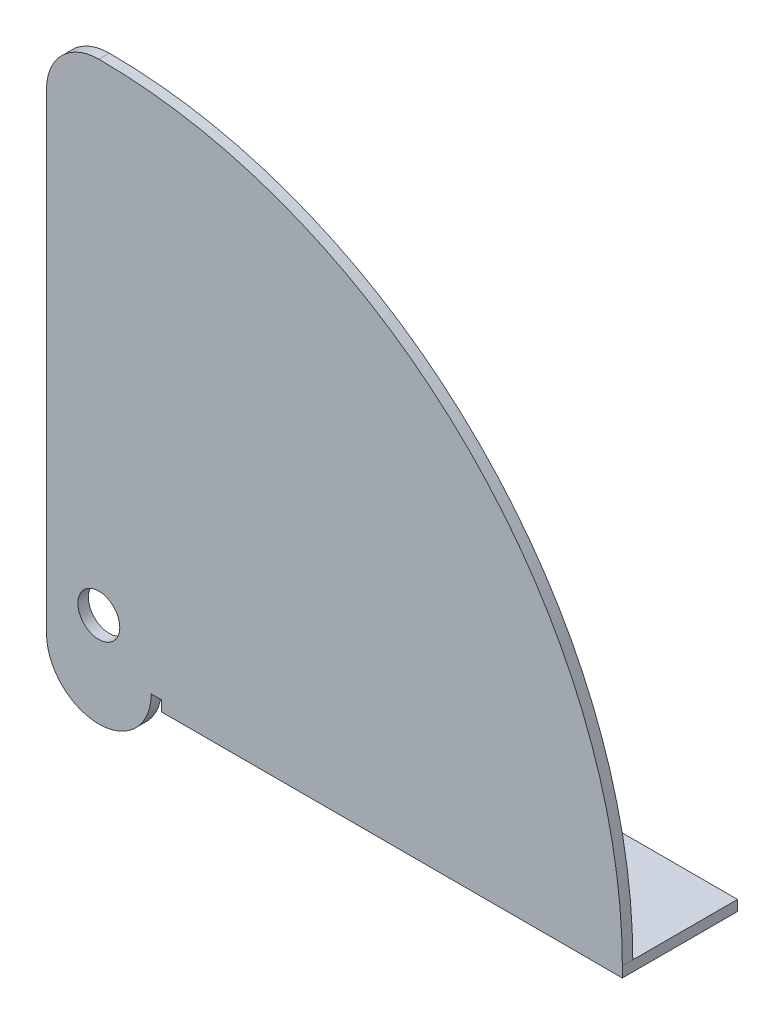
from build123d import *

# Parameters (mm, degrees)
SKETCH1_R      = 2
EXTRUDE1_DEPTH = 1
SKETCH5_W      = 44
SKETCH5_H      = 11
SKETCH5_R      = 1.75
EXTRUDE3_DEPTH = 1


with BuildPart() as part:
    # Sketch1 → Extrude1 (new body)
    with BuildSketch(Plane.XY):
        with BuildLine():
            Line((5, 0), (50, 0))
            ThreePointArc((50, 0), (35.355339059, 35.355339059), (0, 50))
            ThreePointArc((0, 50), (-3.535533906, 48.535533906), (-5, 45))
            Line((-5, 45), (-5, 0))
            ThreePointArc((-5, 0), (0, -5), (5, 0))
        make_face()
        with Locations((0, 4)):
            Circle(SKETCH1_R, mode=Mode.SUBTRACT)
    extrude(amount=EXTRUDE1_DEPTH)

    # Sketch5 → Extrude3 (add)
    with BuildSketch(Plane.XZ):
        with Locations((28, -4.5)):
            Rectangle(SKETCH5_W, SKETCH5_H)
        with Locations(Location((16, -5, 0), (0, 0, 90))):
            Circle(SKETCH5_R, mode=Mode.SUBTRACT)
        with Locations(Location((40, -5, 0), (0, 0, 90))):
            Circle(SKETCH5_R, mode=Mode.SUBTRACT)
    extrude(amount=EXTRUDE3_DEPTH)


solid = part.part
